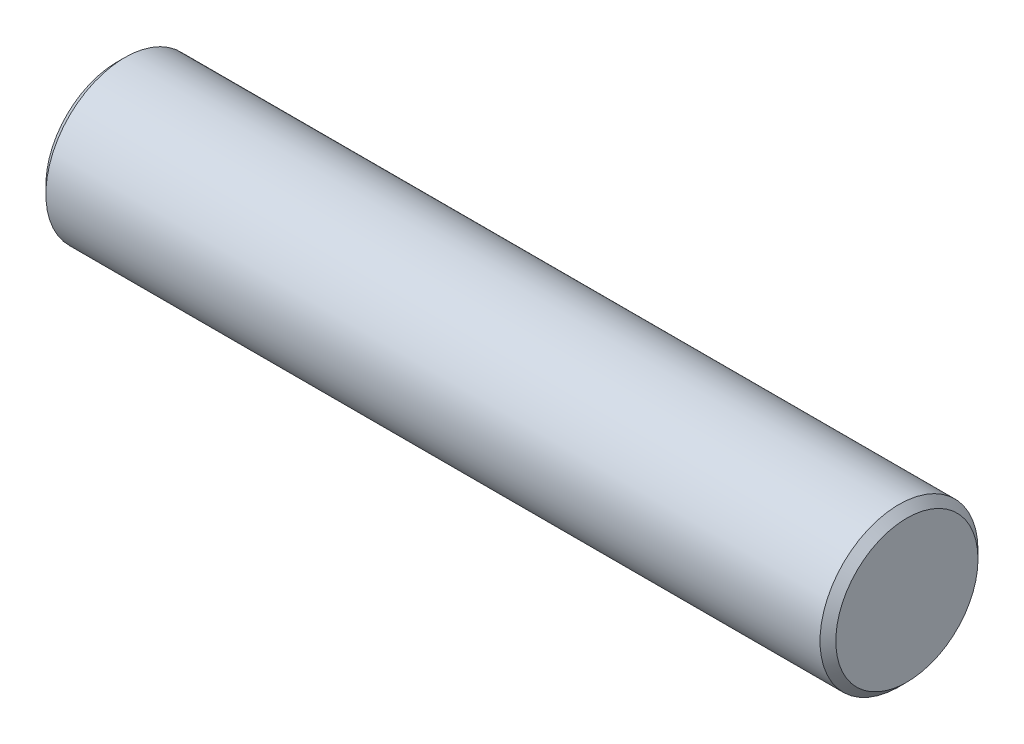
from build123d import *

# Parameters (mm, degrees)
SKETCH_1_R      = 5
EXTRUDE_1_DEPTH = 25
CHAMFER_1_SIZE  = 0.5


with BuildPart() as part:
    # Sketch 1 → Extrude 1 (new, symmetric)
    with BuildSketch(Plane(origin=(0, 0, 0), x_dir=(0, 0, -1), z_dir=(1, 0, 0))):
        Circle(SKETCH_1_R)
    extrude(amount=EXTRUDE_1_DEPTH, both=True)

    # Chamfer 1
    chamfer_1_edges = [part.edges().sort_by_distance(p)[0] for p in [
        (-25, 0, 5),
        (25, 0, 5),
    ]]
    chamfer(chamfer_1_edges, length=CHAMFER_1_SIZE)


solid = part.part
